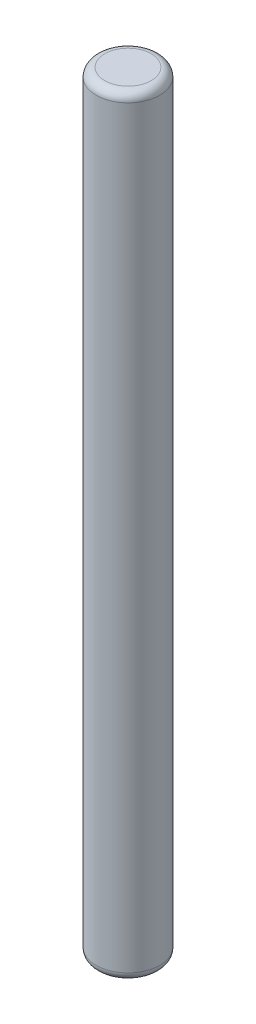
from build123d import *

# Parameters (mm, degrees)
SKETCH_1_R      = 0.375
EXTRUDE_1_DEPTH = 9.1
FILLET_1_R      = 0.1


with BuildPart() as part:
    # Sketch 1 → Extrude 1 (new body)
    with BuildSketch(Plane(origin=(0, 0, 0), x_dir=(1, 0, 0), z_dir=(0, 1, 0))):
        with Locations(Location((0, 0, 0), (0, 0, 270))):
            Circle(SKETCH_1_R)
    extrude(amount=EXTRUDE_1_DEPTH)

    # Fillet 1
    fillet_1_edges = [part.edges().sort_by_distance(p)[0] for p in [
        (0, 0, -0.375),
        (0, 9.1, -0.375),
    ]]
    fillet(fillet_1_edges, radius=FILLET_1_R)


solid = part.part
